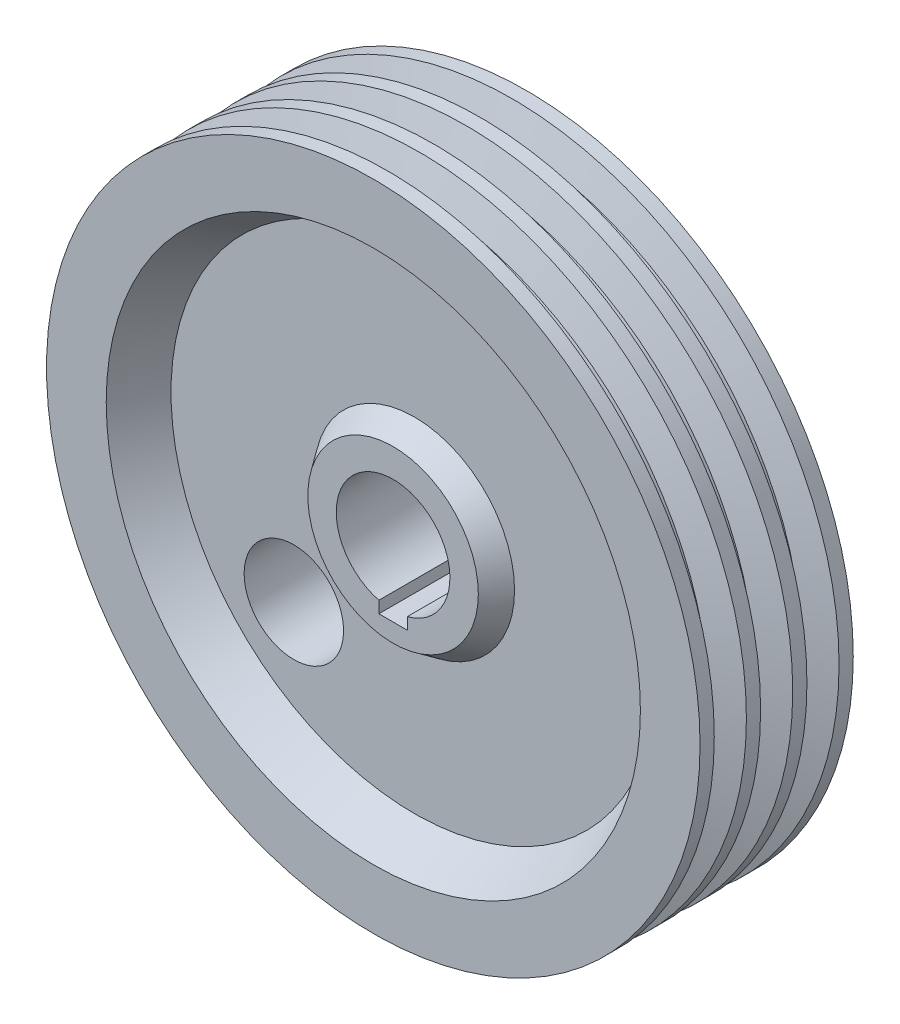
ISO-10303-21;
HEADER;
FILE_DESCRIPTION(('STEP AP214'),'2;1');
FILE_NAME('part.step','',(''),(''),'','','');
FILE_SCHEMA(('AUTOMOTIVE_DESIGN { 1 0 10303 214 1 1 1 1 }'));
ENDSEC;
DATA;
#1=APPLICATION_CONTEXT('core data for automotive mechanical design processes');
#2=APPLICATION_PROTOCOL_DEFINITION('international standard','automotive_design',2000,#1);
#3=PRODUCT_CONTEXT('',#1,'mechanical');
#4=PRODUCT('Part','Part','',(#3));
#5=PRODUCT_RELATED_PRODUCT_CATEGORY('part','',(#4));
#6=PRODUCT_DEFINITION_FORMATION('','',#4);
#7=PRODUCT_DEFINITION_CONTEXT('part definition',#1,'design');
#8=PRODUCT_DEFINITION('design','',#6,#7);
#9=PRODUCT_DEFINITION_SHAPE('','',#8);
#10=(LENGTH_UNIT() NAMED_UNIT(*) SI_UNIT(.MILLI.,.METRE.));
#11=(NAMED_UNIT(*) PLANE_ANGLE_UNIT() SI_UNIT($,.RADIAN.));
#12=(NAMED_UNIT(*) SI_UNIT($,.STERADIAN.) SOLID_ANGLE_UNIT());
#13=UNCERTAINTY_MEASURE_WITH_UNIT(LENGTH_MEASURE(1.E-05),#10,'distance_accuracy_value','');
#14=(GEOMETRIC_REPRESENTATION_CONTEXT(3) GLOBAL_UNCERTAINTY_ASSIGNED_CONTEXT((#13)) GLOBAL_UNIT_ASSIGNED_CONTEXT((#10,
#11,#12)) REPRESENTATION_CONTEXT('',''));
#15=CARTESIAN_POINT('',(0.,0.,0.));
#16=DIRECTION('',(0.,0.,1.));
#17=DIRECTION('',(1.,0.,0.));
#18=AXIS2_PLACEMENT_3D('',#15,#16,#17);
#19=CARTESIAN_POINT('',(0.,0.,-12.5));
#20=DIRECTION('',(0.,0.,-1.));
#21=DIRECTION('',(-1.,0.,0.));
#22=AXIS2_PLACEMENT_3D('',#19,#20,#21);
#23=CONICAL_SURFACE('',#22,85.6521134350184,0.523598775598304);
#24=CARTESIAN_POINT('',(0.,0.,-26.9589636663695));
#25=DIRECTION('',(0.,0.,1.));
#26=DIRECTION('',(1.,0.,0.));
#27=AXIS2_PLACEMENT_3D('',#24,#25,#26);
#28=CIRCLE('',#27,94.);
#29=CARTESIAN_POINT('',(94.,0.,-26.9589636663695));
#30=VERTEX_POINT('',#29);
#31=EDGE_CURVE('E89',#30,#30,#28,.T.);
#32=ORIENTED_EDGE('',*,*,#31,.F.);
#33=EDGE_LOOP('',(#32));
#34=FACE_BOUND('',#33,.T.);
#35=CARTESIAN_POINT('',(0.,0.,-12.5));
#36=DIRECTION('',(0.,0.,1.));
#37=DIRECTION('',(1.,0.,0.));
#38=AXIS2_PLACEMENT_3D('',#35,#36,#37);
#39=CIRCLE('',#38,85.6521134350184);
#40=CARTESIAN_POINT('',(85.6521134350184,0.,-12.5));
#41=VERTEX_POINT('',#40);
#42=EDGE_CURVE('E74',#41,#41,#39,.T.);
#43=ORIENTED_EDGE('',*,*,#42,.T.);
#44=EDGE_LOOP('',(#43));
#45=FACE_BOUND('',#44,.T.);
#46=ADVANCED_FACE('F26',(#34,#45),#23,.F.);
#47=CARTESIAN_POINT('',(85.6521134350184,0.,-12.5));
#48=DIRECTION('',(0.,0.,1.));
#49=DIRECTION('',(1.,0.,0.));
#50=AXIS2_PLACEMENT_3D('',#47,#48,#49);
#51=PLANE('',#50);
#52=CARTESIAN_POINT('',(-42.4264068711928,-42.4264068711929,-12.5));
#53=DIRECTION('',(0.,0.,-1.));
#54=DIRECTION('',(0.,1.,0.));
#55=AXIS2_PLACEMENT_3D('',#52,#53,#54);
#56=CIRCLE('',#55,17.5);
#57=CARTESIAN_POINT('',(-42.4264068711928,-24.9264068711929,-12.5));
#58=VERTEX_POINT('',#57);
#59=EDGE_CURVE('E421',#58,#58,#56,.T.);
#60=ORIENTED_EDGE('',*,*,#59,.F.);
#61=EDGE_LOOP('',(#60));
#62=FACE_BOUND('',#61,.T.);
#63=ORIENTED_EDGE('',*,*,#42,.F.);
#64=EDGE_LOOP('',(#63));
#65=FACE_BOUND('',#64,.T.);
#66=CARTESIAN_POINT('',(0.,0.,-12.5));
#67=DIRECTION('',(0.,0.,1.));
#68=DIRECTION('',(1.,0.,0.));
#69=AXIS2_PLACEMENT_3D('',#66,#67,#68);
#70=CIRCLE('',#69,35.2515565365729);
#71=CARTESIAN_POINT('',(35.2515565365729,0.,-12.5));
#72=VERTEX_POINT('',#71);
#73=EDGE_CURVE('E153',#72,#72,#70,.T.);
#74=ORIENTED_EDGE('',*,*,#73,.T.);
#75=EDGE_LOOP('',(#74));
#76=FACE_BOUND('',#75,.T.);
#77=ADVANCED_FACE('F161',(#62,#65,#76),#51,.F.);
#78=CARTESIAN_POINT('',(0.,0.,-20.));
#79=DIRECTION('',(0.,0.,1.));
#80=DIRECTION('',(1.,0.,0.));
#81=AXIS2_PLACEMENT_3D('',#78,#79,#80);
#82=CONICAL_SURFACE('',#81,30.,0.610865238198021);
#83=ORIENTED_EDGE('',*,*,#73,.F.);
#84=EDGE_LOOP('',(#83));
#85=FACE_BOUND('',#84,.T.);
#86=CARTESIAN_POINT('',(0.,0.,-20.));
#87=DIRECTION('',(0.,0.,1.));
#88=DIRECTION('',(1.,0.,0.));
#89=AXIS2_PLACEMENT_3D('',#86,#87,#88);
#90=CIRCLE('',#89,30.);
#91=CARTESIAN_POINT('',(30.,0.,-20.));
#92=VERTEX_POINT('',#91);
#93=EDGE_CURVE('E150',#92,#92,#90,.T.);
#94=ORIENTED_EDGE('',*,*,#93,.T.);
#95=EDGE_LOOP('',(#94));
#96=FACE_BOUND('',#95,.T.);
#97=ADVANCED_FACE('F164',(#85,#96),#82,.T.);
#98=CARTESIAN_POINT('',(30.,0.,-20.));
#99=DIRECTION('',(0.,0.,1.));
#100=DIRECTION('',(1.,0.,0.));
#101=AXIS2_PLACEMENT_3D('',#98,#99,#100);
#102=PLANE('',#101);
#103=CARTESIAN_POINT('',(0.,0.,-20.));
#104=DIRECTION('',(0.,0.,-1.));
#105=DIRECTION('',(0.,1.,0.));
#106=AXIS2_PLACEMENT_3D('',#103,#104,#105);
#107=CIRCLE('',#106,20.);
#108=CARTESIAN_POINT('',(-5.,-19.3649167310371,-20.));
#109=VERTEX_POINT('',#108);
#110=CARTESIAN_POINT('',(5.,-19.3649167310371,-20.));
#111=VERTEX_POINT('',#110);
#112=EDGE_CURVE('E81',#109,#111,#107,.T.);
#113=ORIENTED_EDGE('',*,*,#112,.F.);
#114=DIRECTION('',(0.,1.,0.));
#115=VECTOR('',#114,1.);
#116=CARTESIAN_POINT('',(-5.,-23.5,-20.));
#117=LINE('',#116,#115);
#118=CARTESIAN_POINT('',(-5.,-23.5,-20.));
#119=VERTEX_POINT('',#118);
#120=EDGE_CURVE('E427',#119,#109,#117,.T.);
#121=ORIENTED_EDGE('',*,*,#120,.F.);
#122=DIRECTION('',(-1.,0.,0.));
#123=VECTOR('',#122,1.);
#124=CARTESIAN_POINT('',(-5.,-23.5,-20.));
#125=LINE('',#124,#123);
#126=CARTESIAN_POINT('',(5.,-23.5,-20.));
#127=VERTEX_POINT('',#126);
#128=EDGE_CURVE('E83',#127,#119,#125,.T.);
#129=ORIENTED_EDGE('',*,*,#128,.F.);
#130=DIRECTION('',(0.,-1.,0.));
#131=VECTOR('',#130,1.);
#132=CARTESIAN_POINT('',(5.,-23.5,-20.));
#133=LINE('',#132,#131);
#134=EDGE_CURVE('E68',#111,#127,#133,.T.);
#135=ORIENTED_EDGE('',*,*,#134,.F.);
#136=EDGE_LOOP('',(#113,#121,#129,#135));
#137=FACE_BOUND('',#136,.T.);
#138=ORIENTED_EDGE('',*,*,#93,.F.);
#139=EDGE_LOOP('',(#138));
#140=FACE_BOUND('',#139,.T.);
#141=ADVANCED_FACE('F78',(#137,#140),#102,.F.);
#142=CARTESIAN_POINT('',(30.,0.,20.));
#143=DIRECTION('',(0.,0.,-1.));
#144=DIRECTION('',(-1.,0.,0.));
#145=AXIS2_PLACEMENT_3D('',#142,#143,#144);
#146=PLANE('',#145);
#147=DIRECTION('',(-1.,0.,0.));
#148=VECTOR('',#147,1.);
#149=CARTESIAN_POINT('',(30.,-23.5,20.));
#150=LINE('',#149,#148);
#151=CARTESIAN_POINT('',(5.,-23.5,20.));
#152=VERTEX_POINT('',#151);
#153=CARTESIAN_POINT('',(-5.,-23.5,20.));
#154=VERTEX_POINT('',#153);
#155=EDGE_CURVE('E11',#152,#154,#150,.T.);
#156=ORIENTED_EDGE('',*,*,#155,.T.);
#157=DIRECTION('',(0.,1.,0.));
#158=VECTOR('',#157,1.);
#159=CARTESIAN_POINT('',(-5.,0.,20.));
#160=LINE('',#159,#158);
#161=CARTESIAN_POINT('',(-5.,-19.3649167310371,20.));
#162=VERTEX_POINT('',#161);
#163=EDGE_CURVE('E87',#154,#162,#160,.T.);
#164=ORIENTED_EDGE('',*,*,#163,.T.);
#165=CARTESIAN_POINT('',(0.,0.,20.));
#166=DIRECTION('',(0.,0.,-1.));
#167=DIRECTION('',(-1.,0.,0.));
#168=AXIS2_PLACEMENT_3D('',#165,#166,#167);
#169=CIRCLE('',#168,20.);
#170=CARTESIAN_POINT('',(4.99999999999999,-19.3649167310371,20.));
#171=VERTEX_POINT('',#170);
#172=EDGE_CURVE('E86',#162,#171,#169,.T.);
#173=ORIENTED_EDGE('',*,*,#172,.T.);
#174=DIRECTION('',(0.,-1.,0.));
#175=VECTOR('',#174,1.);
#176=CARTESIAN_POINT('',(4.99999999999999,0.,20.));
#177=LINE('',#176,#175);
#178=EDGE_CURVE('E41',#171,#152,#177,.T.);
#179=ORIENTED_EDGE('',*,*,#178,.T.);
#180=EDGE_LOOP('',(#156,#164,#173,#179));
#181=FACE_BOUND('',#180,.T.);
#182=CARTESIAN_POINT('',(0.,0.,20.));
#183=DIRECTION('',(0.,0.,1.));
#184=DIRECTION('',(1.,0.,0.));
#185=AXIS2_PLACEMENT_3D('',#182,#183,#184);
#186=CIRCLE('',#185,30.);
#187=CARTESIAN_POINT('',(30.,0.,20.));
#188=VERTEX_POINT('',#187);
#189=EDGE_CURVE('E147',#188,#188,#186,.T.);
#190=ORIENTED_EDGE('',*,*,#189,.T.);
#191=EDGE_LOOP('',(#190));
#192=FACE_BOUND('',#191,.T.);
#193=ADVANCED_FACE('F173',(#181,#192),#146,.F.);
#194=CARTESIAN_POINT('',(0.,0.,12.5));
#195=DIRECTION('',(0.,0.,-1.));
#196=DIRECTION('',(-1.,0.,0.));
#197=AXIS2_PLACEMENT_3D('',#194,#195,#196);
#198=CONICAL_SURFACE('',#197,35.2515565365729,0.610865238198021);
#199=ORIENTED_EDGE('',*,*,#189,.F.);
#200=EDGE_LOOP('',(#199));
#201=FACE_BOUND('',#200,.T.);
#202=CARTESIAN_POINT('',(0.,0.,12.5));
#203=DIRECTION('',(0.,0.,1.));
#204=DIRECTION('',(1.,0.,0.));
#205=AXIS2_PLACEMENT_3D('',#202,#203,#204);
#206=CIRCLE('',#205,35.2515565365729);
#207=CARTESIAN_POINT('',(35.2515565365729,0.,12.5));
#208=VERTEX_POINT('',#207);
#209=EDGE_CURVE('E144',#208,#208,#206,.T.);
#210=ORIENTED_EDGE('',*,*,#209,.T.);
#211=EDGE_LOOP('',(#210));
#212=FACE_BOUND('',#211,.T.);
#213=ADVANCED_FACE('F179',(#201,#212),#198,.T.);
#214=CARTESIAN_POINT('',(85.6521134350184,0.,12.5));
#215=DIRECTION('',(0.,0.,-1.));
#216=DIRECTION('',(-1.,0.,0.));
#217=AXIS2_PLACEMENT_3D('',#214,#215,#216);
#218=PLANE('',#217);
#219=CARTESIAN_POINT('',(-42.4264068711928,-42.4264068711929,12.5));
#220=DIRECTION('',(0.,0.,-1.));
#221=DIRECTION('',(-1.,0.,0.));
#222=AXIS2_PLACEMENT_3D('',#219,#220,#221);
#223=CIRCLE('',#222,17.5);
#224=CARTESIAN_POINT('',(-59.9264068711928,-42.4264068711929,12.5));
#225=VERTEX_POINT('',#224);
#226=EDGE_CURVE('E29',#225,#225,#223,.T.);
#227=ORIENTED_EDGE('',*,*,#226,.T.);
#228=EDGE_LOOP('',(#227));
#229=FACE_BOUND('',#228,.T.);
#230=ORIENTED_EDGE('',*,*,#209,.F.);
#231=EDGE_LOOP('',(#230));
#232=FACE_BOUND('',#231,.T.);
#233=CARTESIAN_POINT('',(0.,0.,12.5));
#234=DIRECTION('',(0.,0.,1.));
#235=DIRECTION('',(1.,0.,0.));
#236=AXIS2_PLACEMENT_3D('',#233,#234,#235);
#237=CIRCLE('',#236,85.6521134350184);
#238=CARTESIAN_POINT('',(85.6521134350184,0.,12.5));
#239=VERTEX_POINT('',#238);
#240=EDGE_CURVE('E141',#239,#239,#237,.T.);
#241=ORIENTED_EDGE('',*,*,#240,.T.);
#242=EDGE_LOOP('',(#241));
#243=FACE_BOUND('',#242,.T.);
#244=ADVANCED_FACE('F258',(#229,#232,#243),#218,.F.);
#245=CARTESIAN_POINT('',(0.,0.,26.9589636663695));
#246=DIRECTION('',(0.,0.,1.));
#247=DIRECTION('',(1.,0.,0.));
#248=AXIS2_PLACEMENT_3D('',#245,#246,#247);
#249=CONICAL_SURFACE('',#248,94.,0.523598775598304);
#250=ORIENTED_EDGE('',*,*,#240,.F.);
#251=EDGE_LOOP('',(#250));
#252=FACE_BOUND('',#251,.T.);
#253=CARTESIAN_POINT('',(0.,0.,26.9589636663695));
#254=DIRECTION('',(0.,0.,1.));
#255=DIRECTION('',(1.,0.,0.));
#256=AXIS2_PLACEMENT_3D('',#253,#254,#255);
#257=CIRCLE('',#256,94.);
#258=CARTESIAN_POINT('',(94.,0.,26.9589636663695));
#259=VERTEX_POINT('',#258);
#260=EDGE_CURVE('E138',#259,#259,#257,.T.);
#261=ORIENTED_EDGE('',*,*,#260,.T.);
#262=EDGE_LOOP('',(#261));
#263=FACE_BOUND('',#262,.T.);
#264=ADVANCED_FACE('F254',(#252,#263),#249,.F.);
#265=CARTESIAN_POINT('',(115.,0.,26.9589636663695));
#266=DIRECTION('',(0.,0.,-1.));
#267=DIRECTION('',(-1.,0.,0.));
#268=AXIS2_PLACEMENT_3D('',#265,#266,#267);
#269=PLANE('',#268);
#270=ORIENTED_EDGE('',*,*,#260,.F.);
#271=EDGE_LOOP('',(#270));
#272=FACE_BOUND('',#271,.T.);
#273=CARTESIAN_POINT('',(0.,0.,26.9589636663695));
#274=DIRECTION('',(0.,0.,1.));
#275=DIRECTION('',(1.,0.,0.));
#276=AXIS2_PLACEMENT_3D('',#273,#274,#275);
#277=CIRCLE('',#276,115.);
#278=CARTESIAN_POINT('',(115.,0.,26.9589636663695));
#279=VERTEX_POINT('',#278);
#280=EDGE_CURVE('E135',#279,#279,#277,.T.);
#281=ORIENTED_EDGE('',*,*,#280,.T.);
#282=EDGE_LOOP('',(#281));
#283=FACE_BOUND('',#282,.T.);
#284=ADVANCED_FACE('F250',(#272,#283),#269,.F.);
#285=CARTESIAN_POINT('',(0.,0.,65.6421686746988));
#286=DIRECTION('',(0.,0.,1.));
#287=DIRECTION('',(1.,0.,0.));
#288=AXIS2_PLACEMENT_3D('',#285,#286,#287);
#289=CYLINDRICAL_SURFACE('',#288,115.);
#290=ORIENTED_EDGE('',*,*,#280,.F.);
#291=EDGE_LOOP('',(#290));
#292=FACE_BOUND('',#291,.T.);
#293=CARTESIAN_POINT('',(0.,0.,21.9589636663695));
#294=DIRECTION('',(0.,0.,1.));
#295=DIRECTION('',(1.,0.,0.));
#296=AXIS2_PLACEMENT_3D('',#293,#294,#295);
#297=CIRCLE('',#296,115.);
#298=CARTESIAN_POINT('',(115.,0.,21.9589636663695));
#299=VERTEX_POINT('',#298);
#300=EDGE_CURVE('E132',#299,#299,#297,.T.);
#301=ORIENTED_EDGE('',*,*,#300,.T.);
#302=EDGE_LOOP('',(#301));
#303=FACE_BOUND('',#302,.T.);
#304=ADVANCED_FACE('F246',(#292,#303),#289,.T.);
#305=CARTESIAN_POINT('',(0.,0.,18.8059757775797));
#306=DIRECTION('',(0.,0.,1.));
#307=DIRECTION('',(1.,0.,0.));
#308=AXIS2_PLACEMENT_3D('',#305,#306,#307);
#309=CONICAL_SURFACE('',#308,105.,1.26536370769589);
#310=ORIENTED_EDGE('',*,*,#300,.F.);
#311=EDGE_LOOP('',(#310));
#312=FACE_BOUND('',#311,.T.);
#313=CARTESIAN_POINT('',(0.,0.,18.8059757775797));
#314=DIRECTION('',(0.,0.,1.));
#315=DIRECTION('',(1.,0.,0.));
#316=AXIS2_PLACEMENT_3D('',#313,#314,#315);
#317=CIRCLE('',#316,105.);
#318=CARTESIAN_POINT('',(105.,0.,18.8059757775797));
#319=VERTEX_POINT('',#318);
#320=EDGE_CURVE('E129',#319,#319,#317,.T.);
#321=ORIENTED_EDGE('',*,*,#320,.T.);
#322=EDGE_LOOP('',(#321));
#323=FACE_BOUND('',#322,.T.);
#324=ADVANCED_FACE('F242',(#312,#323),#309,.T.);
#325=CARTESIAN_POINT('',(0.,0.,65.6421686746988));
#326=DIRECTION('',(0.,0.,1.));
#327=DIRECTION('',(1.,0.,0.));
#328=AXIS2_PLACEMENT_3D('',#325,#326,#327);
#329=CYLINDRICAL_SURFACE('',#328,105.);
#330=ORIENTED_EDGE('',*,*,#320,.F.);
#331=EDGE_LOOP('',(#330));
#332=FACE_BOUND('',#331,.T.);
#333=CARTESIAN_POINT('',(0.,0.,13.8059757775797));
#334=DIRECTION('',(0.,0.,1.));
#335=DIRECTION('',(1.,0.,0.));
#336=AXIS2_PLACEMENT_3D('',#333,#334,#335);
#337=CIRCLE('',#336,105.);
#338=CARTESIAN_POINT('',(105.,0.,13.8059757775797));
#339=VERTEX_POINT('',#338);
#340=EDGE_CURVE('E126',#339,#339,#337,.T.);
#341=ORIENTED_EDGE('',*,*,#340,.T.);
#342=EDGE_LOOP('',(#341));
#343=FACE_BOUND('',#342,.T.);
#344=ADVANCED_FACE('F238',(#332,#343),#329,.T.);
#345=CARTESIAN_POINT('',(0.,0.,10.6529878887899));
#346=DIRECTION('',(0.,0.,-1.));
#347=DIRECTION('',(-1.,0.,0.));
#348=AXIS2_PLACEMENT_3D('',#345,#346,#347);
#349=CONICAL_SURFACE('',#348,115.,1.26536370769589);
#350=ORIENTED_EDGE('',*,*,#340,.F.);
#351=EDGE_LOOP('',(#350));
#352=FACE_BOUND('',#351,.T.);
#353=CARTESIAN_POINT('',(0.,0.,10.6529878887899));
#354=DIRECTION('',(0.,0.,1.));
#355=DIRECTION('',(1.,0.,0.));
#356=AXIS2_PLACEMENT_3D('',#353,#354,#355);
#357=CIRCLE('',#356,115.);
#358=CARTESIAN_POINT('',(115.,0.,10.6529878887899));
#359=VERTEX_POINT('',#358);
#360=EDGE_CURVE('E123',#359,#359,#357,.T.);
#361=ORIENTED_EDGE('',*,*,#360,.T.);
#362=EDGE_LOOP('',(#361));
#363=FACE_BOUND('',#362,.T.);
#364=ADVANCED_FACE('F234',(#352,#363),#349,.T.);
#365=CARTESIAN_POINT('',(0.,0.,65.6421686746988));
#366=DIRECTION('',(0.,0.,1.));
#367=DIRECTION('',(1.,0.,0.));
#368=AXIS2_PLACEMENT_3D('',#365,#366,#367);
#369=CYLINDRICAL_SURFACE('',#368,115.);
#370=ORIENTED_EDGE('',*,*,#360,.F.);
#371=EDGE_LOOP('',(#370));
#372=FACE_BOUND('',#371,.T.);
#373=CARTESIAN_POINT('',(0.,0.,5.65298788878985));
#374=DIRECTION('',(0.,0.,1.));
#375=DIRECTION('',(1.,0.,0.));
#376=AXIS2_PLACEMENT_3D('',#373,#374,#375);
#377=CIRCLE('',#376,115.);
#378=CARTESIAN_POINT('',(115.,0.,5.65298788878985));
#379=VERTEX_POINT('',#378);
#380=EDGE_CURVE('E120',#379,#379,#377,.T.);
#381=ORIENTED_EDGE('',*,*,#380,.T.);
#382=EDGE_LOOP('',(#381));
#383=FACE_BOUND('',#382,.T.);
#384=ADVANCED_FACE('F230',(#372,#383),#369,.T.);
#385=CARTESIAN_POINT('',(0.,0.,2.5));
#386=DIRECTION('',(0.,0.,1.));
#387=DIRECTION('',(1.,0.,0.));
#388=AXIS2_PLACEMENT_3D('',#385,#386,#387);
#389=CONICAL_SURFACE('',#388,105.,1.26536370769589);
#390=ORIENTED_EDGE('',*,*,#380,.F.);
#391=EDGE_LOOP('',(#390));
#392=FACE_BOUND('',#391,.T.);
#393=CARTESIAN_POINT('',(0.,0.,2.5));
#394=DIRECTION('',(0.,0.,1.));
#395=DIRECTION('',(1.,0.,0.));
#396=AXIS2_PLACEMENT_3D('',#393,#394,#395);
#397=CIRCLE('',#396,105.);
#398=CARTESIAN_POINT('',(105.,0.,2.5));
#399=VERTEX_POINT('',#398);
#400=EDGE_CURVE('E117',#399,#399,#397,.T.);
#401=ORIENTED_EDGE('',*,*,#400,.T.);
#402=EDGE_LOOP('',(#401));
#403=FACE_BOUND('',#402,.T.);
#404=ADVANCED_FACE('F226',(#392,#403),#389,.T.);
#405=CARTESIAN_POINT('',(0.,0.,65.6421686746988));
#406=DIRECTION('',(0.,0.,1.));
#407=DIRECTION('',(1.,0.,0.));
#408=AXIS2_PLACEMENT_3D('',#405,#406,#407);
#409=CYLINDRICAL_SURFACE('',#408,105.);
#410=ORIENTED_EDGE('',*,*,#400,.F.);
#411=EDGE_LOOP('',(#410));
#412=FACE_BOUND('',#411,.T.);
#413=CARTESIAN_POINT('',(0.,0.,-2.5));
#414=DIRECTION('',(0.,0.,1.));
#415=DIRECTION('',(1.,0.,0.));
#416=AXIS2_PLACEMENT_3D('',#413,#414,#415);
#417=CIRCLE('',#416,105.);
#418=CARTESIAN_POINT('',(105.,0.,-2.5));
#419=VERTEX_POINT('',#418);
#420=EDGE_CURVE('E114',#419,#419,#417,.T.);
#421=ORIENTED_EDGE('',*,*,#420,.T.);
#422=EDGE_LOOP('',(#421));
#423=FACE_BOUND('',#422,.T.);
#424=ADVANCED_FACE('F222',(#412,#423),#409,.T.);
#425=CARTESIAN_POINT('',(0.,0.,-5.65298788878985));
#426=DIRECTION('',(0.,0.,-1.));
#427=DIRECTION('',(-1.,0.,0.));
#428=AXIS2_PLACEMENT_3D('',#425,#426,#427);
#429=CONICAL_SURFACE('',#428,115.,1.26536370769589);
#430=ORIENTED_EDGE('',*,*,#420,.F.);
#431=EDGE_LOOP('',(#430));
#432=FACE_BOUND('',#431,.T.);
#433=CARTESIAN_POINT('',(0.,0.,-5.65298788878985));
#434=DIRECTION('',(0.,0.,1.));
#435=DIRECTION('',(1.,0.,0.));
#436=AXIS2_PLACEMENT_3D('',#433,#434,#435);
#437=CIRCLE('',#436,115.);
#438=CARTESIAN_POINT('',(115.,0.,-5.65298788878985));
#439=VERTEX_POINT('',#438);
#440=EDGE_CURVE('E111',#439,#439,#437,.T.);
#441=ORIENTED_EDGE('',*,*,#440,.T.);
#442=EDGE_LOOP('',(#441));
#443=FACE_BOUND('',#442,.T.);
#444=ADVANCED_FACE('F218',(#432,#443),#429,.T.);
#445=CARTESIAN_POINT('',(0.,0.,65.6421686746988));
#446=DIRECTION('',(0.,0.,1.));
#447=DIRECTION('',(1.,0.,0.));
#448=AXIS2_PLACEMENT_3D('',#445,#446,#447);
#449=CYLINDRICAL_SURFACE('',#448,115.);
#450=ORIENTED_EDGE('',*,*,#440,.F.);
#451=EDGE_LOOP('',(#450));
#452=FACE_BOUND('',#451,.T.);
#453=CARTESIAN_POINT('',(0.,0.,-10.6529878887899));
#454=DIRECTION('',(0.,0.,1.));
#455=DIRECTION('',(1.,0.,0.));
#456=AXIS2_PLACEMENT_3D('',#453,#454,#455);
#457=CIRCLE('',#456,115.);
#458=CARTESIAN_POINT('',(115.,0.,-10.6529878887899));
#459=VERTEX_POINT('',#458);
#460=EDGE_CURVE('E108',#459,#459,#457,.T.);
#461=ORIENTED_EDGE('',*,*,#460,.T.);
#462=EDGE_LOOP('',(#461));
#463=FACE_BOUND('',#462,.T.);
#464=ADVANCED_FACE('F214',(#452,#463),#449,.T.);
#465=CARTESIAN_POINT('',(0.,0.,-13.8059757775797));
#466=DIRECTION('',(0.,0.,1.));
#467=DIRECTION('',(1.,0.,0.));
#468=AXIS2_PLACEMENT_3D('',#465,#466,#467);
#469=CONICAL_SURFACE('',#468,105.,1.26536370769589);
#470=ORIENTED_EDGE('',*,*,#460,.F.);
#471=EDGE_LOOP('',(#470));
#472=FACE_BOUND('',#471,.T.);
#473=CARTESIAN_POINT('',(0.,0.,-13.8059757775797));
#474=DIRECTION('',(0.,0.,1.));
#475=DIRECTION('',(1.,0.,0.));
#476=AXIS2_PLACEMENT_3D('',#473,#474,#475);
#477=CIRCLE('',#476,105.);
#478=CARTESIAN_POINT('',(105.,0.,-13.8059757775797));
#479=VERTEX_POINT('',#478);
#480=EDGE_CURVE('E105',#479,#479,#477,.T.);
#481=ORIENTED_EDGE('',*,*,#480,.T.);
#482=EDGE_LOOP('',(#481));
#483=FACE_BOUND('',#482,.T.);
#484=ADVANCED_FACE('F210',(#472,#483),#469,.T.);
#485=CARTESIAN_POINT('',(0.,0.,65.6421686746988));
#486=DIRECTION('',(0.,0.,1.));
#487=DIRECTION('',(1.,0.,0.));
#488=AXIS2_PLACEMENT_3D('',#485,#486,#487);
#489=CYLINDRICAL_SURFACE('',#488,105.);
#490=ORIENTED_EDGE('',*,*,#480,.F.);
#491=EDGE_LOOP('',(#490));
#492=FACE_BOUND('',#491,.T.);
#493=CARTESIAN_POINT('',(0.,0.,-18.8059757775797));
#494=DIRECTION('',(0.,0.,1.));
#495=DIRECTION('',(1.,0.,0.));
#496=AXIS2_PLACEMENT_3D('',#493,#494,#495);
#497=CIRCLE('',#496,105.);
#498=CARTESIAN_POINT('',(105.,0.,-18.8059757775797));
#499=VERTEX_POINT('',#498);
#500=EDGE_CURVE('E102',#499,#499,#497,.T.);
#501=ORIENTED_EDGE('',*,*,#500,.T.);
#502=EDGE_LOOP('',(#501));
#503=FACE_BOUND('',#502,.T.);
#504=ADVANCED_FACE('F206',(#492,#503),#489,.T.);
#505=CARTESIAN_POINT('',(0.,0.,-21.9589636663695));
#506=DIRECTION('',(0.,0.,-1.));
#507=DIRECTION('',(-1.,0.,0.));
#508=AXIS2_PLACEMENT_3D('',#505,#506,#507);
#509=CONICAL_SURFACE('',#508,115.,1.26536370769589);
#510=ORIENTED_EDGE('',*,*,#500,.F.);
#511=EDGE_LOOP('',(#510));
#512=FACE_BOUND('',#511,.T.);
#513=CARTESIAN_POINT('',(0.,0.,-21.9589636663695));
#514=DIRECTION('',(0.,0.,1.));
#515=DIRECTION('',(1.,0.,0.));
#516=AXIS2_PLACEMENT_3D('',#513,#514,#515);
#517=CIRCLE('',#516,115.);
#518=CARTESIAN_POINT('',(115.,0.,-21.9589636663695));
#519=VERTEX_POINT('',#518);
#520=EDGE_CURVE('E99',#519,#519,#517,.T.);
#521=ORIENTED_EDGE('',*,*,#520,.T.);
#522=EDGE_LOOP('',(#521));
#523=FACE_BOUND('',#522,.T.);
#524=ADVANCED_FACE('F198',(#512,#523),#509,.T.);
#525=CARTESIAN_POINT('',(0.,0.,65.6421686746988));
#526=DIRECTION('',(0.,0.,1.));
#527=DIRECTION('',(1.,0.,0.));
#528=AXIS2_PLACEMENT_3D('',#525,#526,#527);
#529=CYLINDRICAL_SURFACE('',#528,115.);
#530=ORIENTED_EDGE('',*,*,#520,.F.);
#531=EDGE_LOOP('',(#530));
#532=FACE_BOUND('',#531,.T.);
#533=CARTESIAN_POINT('',(0.,0.,-26.9589636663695));
#534=DIRECTION('',(0.,0.,1.));
#535=DIRECTION('',(1.,0.,0.));
#536=AXIS2_PLACEMENT_3D('',#533,#534,#535);
#537=CIRCLE('',#536,115.);
#538=CARTESIAN_POINT('',(115.,0.,-26.9589636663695));
#539=VERTEX_POINT('',#538);
#540=EDGE_CURVE('E96',#539,#539,#537,.T.);
#541=ORIENTED_EDGE('',*,*,#540,.T.);
#542=EDGE_LOOP('',(#541));
#543=FACE_BOUND('',#542,.T.);
#544=ADVANCED_FACE('F189',(#532,#543),#529,.T.);
#545=CARTESIAN_POINT('',(115.,0.,-26.9589636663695));
#546=DIRECTION('',(0.,0.,1.));
#547=DIRECTION('',(1.,0.,0.));
#548=AXIS2_PLACEMENT_3D('',#545,#546,#547);
#549=PLANE('',#548);
#550=ORIENTED_EDGE('',*,*,#540,.F.);
#551=EDGE_LOOP('',(#550));
#552=FACE_BOUND('',#551,.T.);
#553=ORIENTED_EDGE('',*,*,#31,.T.);
#554=EDGE_LOOP('',(#553));
#555=FACE_BOUND('',#554,.T.);
#556=ADVANCED_FACE('F188',(#552,#555),#549,.F.);
#557=CARTESIAN_POINT('',(0.,0.,26.9589636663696));
#558=DIRECTION('',(0.,0.,-1.));
#559=DIRECTION('',(0.,1.,0.));
#560=AXIS2_PLACEMENT_3D('',#557,#558,#559);
#561=CYLINDRICAL_SURFACE('',#560,20.);
#562=ORIENTED_EDGE('',*,*,#172,.F.);
#563=DIRECTION('',(0.,0.,-1.));
#564=VECTOR('',#563,1.);
#565=CARTESIAN_POINT('',(-5.,-19.3649167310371,26.9589636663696));
#566=LINE('',#565,#564);
#567=EDGE_CURVE('E34',#162,#109,#566,.T.);
#568=ORIENTED_EDGE('',*,*,#567,.T.);
#569=ORIENTED_EDGE('',*,*,#112,.T.);
#570=DIRECTION('',(0.,0.,-1.));
#571=VECTOR('',#570,1.);
#572=CARTESIAN_POINT('',(4.99999999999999,-19.3649167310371,26.9589636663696));
#573=LINE('',#572,#571);
#574=EDGE_CURVE('E65',#111,#171,#573,.F.);
#575=ORIENTED_EDGE('',*,*,#574,.T.);
#576=EDGE_LOOP('',(#562,#568,#569,#575));
#577=FACE_BOUND('',#576,.T.);
#578=ADVANCED_FACE('F85',(#577),#561,.F.);
#579=CARTESIAN_POINT('',(-5.,-23.5,26.9589636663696));
#580=DIRECTION('',(0.,-1.,0.));
#581=DIRECTION('',(0.,0.,-1.));
#582=AXIS2_PLACEMENT_3D('',#579,#580,#581);
#583=PLANE('',#582);
#584=DIRECTION('',(0.,0.,-1.));
#585=VECTOR('',#584,1.);
#586=CARTESIAN_POINT('',(5.,-23.5,26.9589636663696));
#587=LINE('',#586,#585);
#588=EDGE_CURVE('E429',#152,#127,#587,.T.);
#589=ORIENTED_EDGE('',*,*,#588,.T.);
#590=ORIENTED_EDGE('',*,*,#128,.T.);
#591=DIRECTION('',(0.,0.,-1.));
#592=VECTOR('',#591,1.);
#593=CARTESIAN_POINT('',(-5.,-23.5,26.9589636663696));
#594=LINE('',#593,#592);
#595=EDGE_CURVE('E430',#154,#119,#594,.T.);
#596=ORIENTED_EDGE('',*,*,#595,.F.);
#597=ORIENTED_EDGE('',*,*,#155,.F.);
#598=EDGE_LOOP('',(#589,#590,#596,#597));
#599=FACE_BOUND('',#598,.T.);
#600=ADVANCED_FACE('F196',(#599),#583,.F.);
#601=CARTESIAN_POINT('',(-5.,-23.5,26.9589636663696));
#602=DIRECTION('',(-1.,0.,0.));
#603=DIRECTION('',(0.,-1.,0.));
#604=AXIS2_PLACEMENT_3D('',#601,#602,#603);
#605=PLANE('',#604);
#606=ORIENTED_EDGE('',*,*,#595,.T.);
#607=ORIENTED_EDGE('',*,*,#120,.T.);
#608=ORIENTED_EDGE('',*,*,#567,.F.);
#609=ORIENTED_EDGE('',*,*,#163,.F.);
#610=EDGE_LOOP('',(#606,#607,#608,#609));
#611=FACE_BOUND('',#610,.T.);
#612=ADVANCED_FACE('F380',(#611),#605,.F.);
#613=CARTESIAN_POINT('',(5.,-23.5,26.9589636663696));
#614=DIRECTION('',(1.,0.,0.));
#615=DIRECTION('',(0.,1.,0.));
#616=AXIS2_PLACEMENT_3D('',#613,#614,#615);
#617=PLANE('',#616);
#618=ORIENTED_EDGE('',*,*,#574,.F.);
#619=ORIENTED_EDGE('',*,*,#134,.T.);
#620=ORIENTED_EDGE('',*,*,#588,.F.);
#621=ORIENTED_EDGE('',*,*,#178,.F.);
#622=EDGE_LOOP('',(#618,#619,#620,#621));
#623=FACE_BOUND('',#622,.T.);
#624=ADVANCED_FACE('F67',(#623),#617,.F.);
#625=CARTESIAN_POINT('',(-42.4264068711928,-42.4264068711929,26.9589636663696));
#626=DIRECTION('',(0.,0.,-1.));
#627=DIRECTION('',(0.,1.,0.));
#628=AXIS2_PLACEMENT_3D('',#625,#626,#627);
#629=CYLINDRICAL_SURFACE('',#628,17.5);
#630=ORIENTED_EDGE('',*,*,#59,.T.);
#631=EDGE_LOOP('',(#630));
#632=FACE_BOUND('',#631,.T.);
#633=ORIENTED_EDGE('',*,*,#226,.F.);
#634=EDGE_LOOP('',(#633));
#635=FACE_BOUND('',#634,.T.);
#636=ADVANCED_FACE('F394',(#632,#635),#629,.F.);
#637=CLOSED_SHELL('',(#46,#77,#97,#141,#193,#213,#244,#264,#284,#304,#324,#344,#364,#384,#404,
#424,#444,#464,#484,#504,#524,#544,#556,#578,#600,#612,#624,#636));
#638=MANIFOLD_SOLID_BREP('B2',#637);
#639=ADVANCED_BREP_SHAPE_REPRESENTATION('',(#18,#638),#14);
#640=SHAPE_DEFINITION_REPRESENTATION(#9,#639);
ENDSEC;
END-ISO-10303-21;
